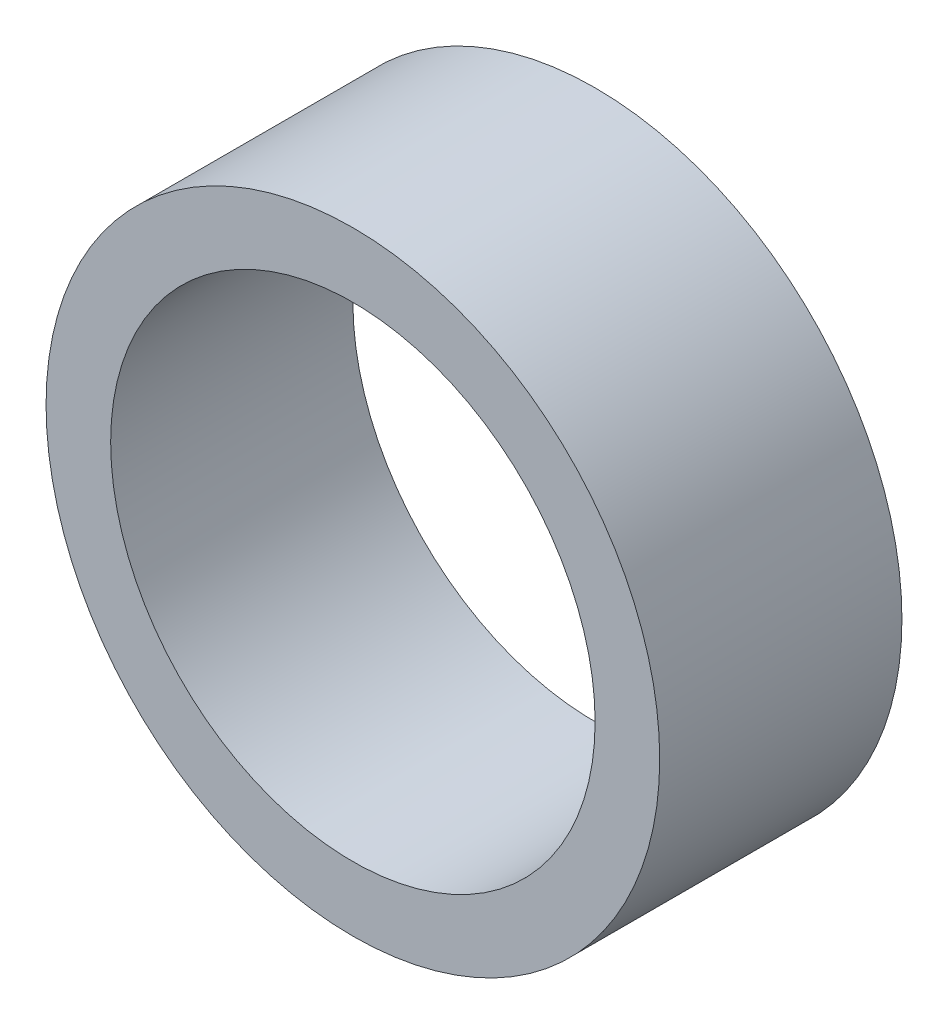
from build123d import *

# Parameters (mm, degrees)
ESQUISSE1_R          = 19
ESQUISSE1_R_2        = 15
BASE_EXTRUSION_DEPTH = 7.5


with BuildPart() as part:
    # Esquisse1 → Base-Extrusion (new, symmetric)
    with BuildSketch(Plane.XY):
        Circle(ESQUISSE1_R)
        Circle(ESQUISSE1_R_2, mode=Mode.SUBTRACT)
    extrude(amount=BASE_EXTRUSION_DEPTH, both=True)


solid = part.part
